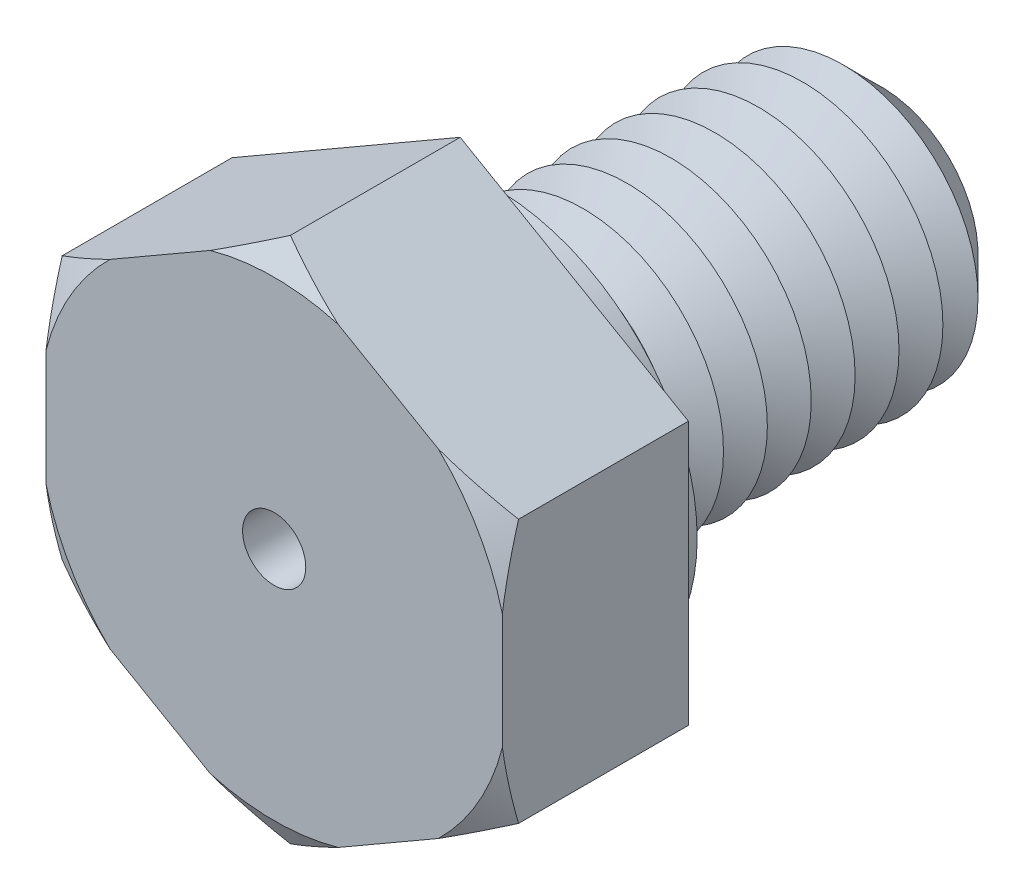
ISO-10303-21;
HEADER;
FILE_DESCRIPTION(('STEP AP214'),'2;1');
FILE_NAME('part.step','',(''),(''),'','','');
FILE_SCHEMA(('AUTOMOTIVE_DESIGN { 1 0 10303 214 1 1 1 1 }'));
ENDSEC;
DATA;
#1=APPLICATION_CONTEXT('core data for automotive mechanical design processes');
#2=APPLICATION_PROTOCOL_DEFINITION('international standard','automotive_design',2000,#1);
#3=PRODUCT_CONTEXT('',#1,'mechanical');
#4=PRODUCT('Part','Part','',(#3));
#5=PRODUCT_RELATED_PRODUCT_CATEGORY('part','',(#4));
#6=PRODUCT_DEFINITION_FORMATION('','',#4);
#7=PRODUCT_DEFINITION_CONTEXT('part definition',#1,'design');
#8=PRODUCT_DEFINITION('design','',#6,#7);
#9=PRODUCT_DEFINITION_SHAPE('','',#8);
#10=(LENGTH_UNIT() NAMED_UNIT(*) SI_UNIT(.MILLI.,.METRE.));
#11=(NAMED_UNIT(*) PLANE_ANGLE_UNIT() SI_UNIT($,.RADIAN.));
#12=(NAMED_UNIT(*) SI_UNIT($,.STERADIAN.) SOLID_ANGLE_UNIT());
#13=UNCERTAINTY_MEASURE_WITH_UNIT(LENGTH_MEASURE(1.E-05),#10,'distance_accuracy_value','');
#14=(GEOMETRIC_REPRESENTATION_CONTEXT(3) GLOBAL_UNCERTAINTY_ASSIGNED_CONTEXT((#13)) GLOBAL_UNIT_ASSIGNED_CONTEXT((#10,
#11,#12)) REPRESENTATION_CONTEXT('',''));
#15=CARTESIAN_POINT('',(0.,0.,0.));
#16=DIRECTION('',(0.,0.,1.));
#17=DIRECTION('',(1.,0.,0.));
#18=AXIS2_PLACEMENT_3D('',#15,#16,#17);
#19=CARTESIAN_POINT('',(6.5,3.75277674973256,5.3));
#20=DIRECTION('',(-0.5,-0.866025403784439,0.));
#21=DIRECTION('',(0.866025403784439,-0.5,0.));
#22=AXIS2_PLACEMENT_3D('',#19,#20,#21);
#23=PLANE('',#22);
#24=CARTESIAN_POINT('',(11.0120510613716,1.14774285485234,2.77920306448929));
#25=CARTESIAN_POINT('',(10.8078344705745,1.26564735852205,2.88939185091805));
#26=CARTESIAN_POINT('',(10.6031290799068,1.38383407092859,2.99839128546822));
#27=CARTESIAN_POINT('',(10.1925345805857,1.6208909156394,3.21345290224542));
#28=CARTESIAN_POINT('',(9.98664532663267,1.73976113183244,3.31951471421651));
#29=CARTESIAN_POINT('',(9.57286478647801,1.97865743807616,3.52844955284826));
#30=CARTESIAN_POINT('',(9.36496919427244,2.09868601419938,3.63131124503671));
#31=CARTESIAN_POINT('',(8.9476201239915,2.33964261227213,3.83272114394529));
#32=CARTESIAN_POINT('',(8.73816669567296,2.46057060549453,3.93126948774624));
#33=CARTESIAN_POINT('',(8.31210847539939,2.70655543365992,4.12554493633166));
#34=CARTESIAN_POINT('',(8.0954571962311,2.83163910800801,4.22113674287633));
#35=CARTESIAN_POINT('',(7.65996896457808,3.0830683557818,4.40550790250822));
#36=CARTESIAN_POINT('',(7.44113190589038,3.2094139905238,4.49428692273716));
#37=CARTESIAN_POINT('',(7.00122142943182,3.46339642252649,4.66334180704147));
#38=CARTESIAN_POINT('',(6.78015039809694,3.59103184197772,4.74362587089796));
#39=CARTESIAN_POINT('',(6.3354128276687,3.8478011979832,4.89383693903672));
#40=CARTESIAN_POINT('',(6.11174662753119,3.97693493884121,4.96376527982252));
#41=CARTESIAN_POINT('',(5.57683009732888,4.2857691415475,5.11501441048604));
#42=CARTESIAN_POINT('',(5.26433342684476,4.46618917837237,5.19069976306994));
#43=CARTESIAN_POINT('',(4.79238520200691,4.73866861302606,5.28165255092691));
#44=CARTESIAN_POINT('',(4.63453792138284,4.82980178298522,5.30820735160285));
#45=CARTESIAN_POINT('',(4.31797843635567,5.01256748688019,5.35312391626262));
#46=CARTESIAN_POINT('',(4.15926635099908,5.10419995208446,5.37148678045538));
#47=CARTESIAN_POINT('',(3.84309853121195,5.28673952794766,5.3993333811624));
#48=CARTESIAN_POINT('',(3.68564943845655,5.37764280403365,5.40891715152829));
#49=CARTESIAN_POINT('',(3.37053331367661,5.55957518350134,5.41928234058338));
#50=CARTESIAN_POINT('',(3.21286628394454,5.65060428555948,5.42006385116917));
#51=CARTESIAN_POINT('',(2.89768626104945,5.83257355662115,5.4127996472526));
#52=CARTESIAN_POINT('',(2.74017326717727,5.92351372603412,5.40475397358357));
#53=CARTESIAN_POINT('',(2.42563627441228,6.10511174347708,5.38007889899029));
#54=CARTESIAN_POINT('',(2.26861235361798,6.19576954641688,5.36344819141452));
#55=CARTESIAN_POINT('',(1.8976455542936,6.40994732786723,5.31443879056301));
#56=CARTESIAN_POINT('',(1.6840512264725,6.53326607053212,5.27851525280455));
#57=CARTESIAN_POINT('',(1.25890710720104,6.77872314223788,5.19313397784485));
#58=CARTESIAN_POINT('',(1.04735761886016,6.90086129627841,5.14367426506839));
#59=CARTESIAN_POINT('',(0.626329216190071,7.14394215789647,5.03308780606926));
#60=CARTESIAN_POINT('',(0.416852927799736,7.26488334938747,4.97194786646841));
#61=CARTESIAN_POINT('',(0.000251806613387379,7.50540811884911,4.83992704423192));
#62=CARTESIAN_POINT('',(-0.206873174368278,7.62499178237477,4.76904677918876));
#63=CARTESIAN_POINT('',(-0.621367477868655,7.86430018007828,4.61833709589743));
#64=CARTESIAN_POINT('',(-0.828710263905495,7.98400959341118,4.53841104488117));
#65=CARTESIAN_POINT('',(-1.2411992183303,8.22216020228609,4.3718486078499));
#66=CARTESIAN_POINT('',(-1.44634674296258,8.34060218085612,4.2852166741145));
#67=CARTESIAN_POINT('',(-1.85477207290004,8.57640665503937,4.10643213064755));
#68=CARTESIAN_POINT('',(-2.05805026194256,8.69376937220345,4.01428068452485));
#69=CARTESIAN_POINT('',(-2.46301289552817,8.92757465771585,3.82542322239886));
#70=CARTESIAN_POINT('',(-2.66469731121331,9.04401720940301,3.72871712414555));
#71=CARTESIAN_POINT('',(-3.00477721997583,9.24036243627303,3.56190249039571));
#72=CARTESIAN_POINT('',(-3.14353507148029,9.32047431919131,3.49277477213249));
#73=CARTESIAN_POINT('',(-3.42044427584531,9.48034792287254,3.35293264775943));
#74=CARTESIAN_POINT('',(-3.55859564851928,9.56010965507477,3.28221829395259));
#75=CARTESIAN_POINT('',(-3.83290330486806,9.71848125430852,3.14014092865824));
#76=CARTESIAN_POINT('',(-3.96906528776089,9.79709441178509,3.06879256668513));
#77=CARTESIAN_POINT('',(-4.24090766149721,9.9540426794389,2.92487520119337));
#78=CARTESIAN_POINT('',(-4.37658804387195,10.0323777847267,2.85230617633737));
#79=CARTESIAN_POINT('',(-4.5120510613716,10.1105873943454,2.77920306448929));
#80=B_SPLINE_CURVE_WITH_KNOTS('',3,(#24,#25,#26,#27,#28,#29,#30,#31,#32,#33,#34,#35,#36,#37,#38,
#39,#40,#41,#42,#43,#44,#45,#46,#47,#48,#49,#50,#51,#52,#53,#54,#55,#56,#57,#58,#59,#60,#61,#62,
#63,#64,#65,#66,#67,#68,#69,#70,#71,#72,#73,#74,#75,#76,#77,#78,#79),.UNSPECIFIED.,.F.,.F.,(4,2,
2,2,2,2,2,2,2,2,2,2,2,2,2,2,2,2,2,2,2,2,2,2,2,2,2,4),(0.,0.780858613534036,1.56181520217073,
2.34527979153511,3.12871946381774,3.93206444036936,4.73544864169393,5.53805016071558,
6.34054800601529,7.44542333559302,7.99784254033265,8.55018753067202,9.096157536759,
9.64212184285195,10.1880836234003,10.7341285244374,11.4813961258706,12.2287728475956,
12.9769988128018,13.7251773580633,14.4822772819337,15.2388787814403,15.9953213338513,
16.7517775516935,17.2752695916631,17.7987444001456,18.3167123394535,18.8346893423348),.UNSPECIFIED.);
#81=CARTESIAN_POINT('',(6.5,3.75277674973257,4.83811978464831));
#82=VERTEX_POINT('',#81);
#83=CARTESIAN_POINT('',(4.67682717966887,4.80538606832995,5.3));
#84=VERTEX_POINT('',#83);
#85=EDGE_CURVE('E132',#82,#84,#80,.T.);
#86=ORIENTED_EDGE('',*,*,#85,.F.);
#87=DIRECTION('',(0.,0.,-1.));
#88=VECTOR('',#87,1.);
#89=CARTESIAN_POINT('',(6.5,3.75277674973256,5.3));
#90=LINE('',#89,#88);
#91=CARTESIAN_POINT('',(6.5,3.75277674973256,0.));
#92=VERTEX_POINT('',#91);
#93=EDGE_CURVE('E144',#82,#92,#90,.T.);
#94=ORIENTED_EDGE('',*,*,#93,.T.);
#95=DIRECTION('',(-0.866025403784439,0.5,0.));
#96=VECTOR('',#95,1.);
#97=CARTESIAN_POINT('',(6.5,3.75277674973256,0.));
#98=LINE('',#97,#96);
#99=CARTESIAN_POINT('',(0.,7.50555349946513,0.));
#100=VERTEX_POINT('',#99);
#101=EDGE_CURVE('E266',#92,#100,#98,.T.);
#102=ORIENTED_EDGE('',*,*,#101,.T.);
#103=DIRECTION('',(0.,0.,-1.));
#104=VECTOR('',#103,1.);
#105=CARTESIAN_POINT('',(0.,7.50555349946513,5.3));
#106=LINE('',#105,#104);
#107=CARTESIAN_POINT('',(0.,7.50555349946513,4.83811978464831));
#108=VERTEX_POINT('',#107);
#109=EDGE_CURVE('E179',#108,#100,#106,.T.);
#110=ORIENTED_EDGE('',*,*,#109,.F.);
#111=CARTESIAN_POINT('',(1.82317282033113,6.45294418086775,5.3));
#112=VERTEX_POINT('',#111);
#113=EDGE_CURVE('E151',#112,#108,#80,.T.);
#114=ORIENTED_EDGE('',*,*,#113,.F.);
#115=DIRECTION('',(-0.866025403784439,0.5,0.));
#116=VECTOR('',#115,1.);
#117=CARTESIAN_POINT('',(6.5,3.75277674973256,5.3));
#118=LINE('',#117,#116);
#119=EDGE_CURVE('E148',#84,#112,#118,.T.);
#120=ORIENTED_EDGE('',*,*,#119,.F.);
#121=EDGE_LOOP('',(#86,#94,#102,#110,#114,#120));
#122=FACE_BOUND('',#121,.T.);
#123=ADVANCED_FACE('F39',(#122),#23,.F.);
#124=CARTESIAN_POINT('',(0.,7.50555349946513,5.3));
#125=DIRECTION('',(0.5,-0.866025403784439,0.));
#126=DIRECTION('',(0.866025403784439,0.5,0.));
#127=AXIS2_PLACEMENT_3D('',#124,#125,#126);
#128=PLANE('',#127);
#129=CARTESIAN_POINT('',(4.5120510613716,10.1105873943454,2.77920306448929));
#130=CARTESIAN_POINT('',(4.30783447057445,9.99268289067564,2.88939185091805));
#131=CARTESIAN_POINT('',(4.1031290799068,9.87449617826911,2.99839128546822));
#132=CARTESIAN_POINT('',(3.69253458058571,9.63743933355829,3.21345290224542));
#133=CARTESIAN_POINT('',(3.48664532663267,9.51856911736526,3.31951471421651));
#134=CARTESIAN_POINT('',(3.07286478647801,9.27967281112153,3.52844955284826));
#135=CARTESIAN_POINT('',(2.86496919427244,9.15964423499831,3.63131124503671));
#136=CARTESIAN_POINT('',(2.4476201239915,8.91868763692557,3.83272114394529));
#137=CARTESIAN_POINT('',(2.23816669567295,8.79775964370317,3.93126948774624));
#138=CARTESIAN_POINT('',(1.81210847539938,8.55177481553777,4.12554493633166));
#139=CARTESIAN_POINT('',(1.5954571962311,8.42669114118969,4.22113674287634));
#140=CARTESIAN_POINT('',(1.15996896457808,8.1752618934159,4.40550790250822));
#141=CARTESIAN_POINT('',(0.941131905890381,8.04891625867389,4.49428692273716));
#142=CARTESIAN_POINT('',(0.501221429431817,7.7949338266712,4.66334180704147));
#143=CARTESIAN_POINT('',(0.280150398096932,7.66729840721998,4.74362587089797));
#144=CARTESIAN_POINT('',(-0.164587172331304,7.4105290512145,4.89383693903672));
#145=CARTESIAN_POINT('',(-0.388253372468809,7.28139531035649,4.96376527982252));
#146=CARTESIAN_POINT('',(-0.923169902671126,6.9725611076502,5.11501441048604));
#147=CARTESIAN_POINT('',(-1.23566657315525,6.79214107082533,5.19069976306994));
#148=CARTESIAN_POINT('',(-1.70761479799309,6.51966163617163,5.28165255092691));
#149=CARTESIAN_POINT('',(-1.86546207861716,6.42852846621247,5.30820735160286));
#150=CARTESIAN_POINT('',(-2.18202156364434,6.24576276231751,5.35312391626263));
#151=CARTESIAN_POINT('',(-2.34073364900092,6.15413029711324,5.37148678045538));
#152=CARTESIAN_POINT('',(-2.65690146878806,5.97159072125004,5.3993333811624));
#153=CARTESIAN_POINT('',(-2.81435056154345,5.88068744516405,5.40891715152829));
#154=CARTESIAN_POINT('',(-3.12946668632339,5.69875506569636,5.41928234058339));
#155=CARTESIAN_POINT('',(-3.28713371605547,5.60772596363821,5.42006385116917));
#156=CARTESIAN_POINT('',(-3.60231373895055,5.42575669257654,5.4127996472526));
#157=CARTESIAN_POINT('',(-3.75982673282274,5.33481652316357,5.40475397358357));
#158=CARTESIAN_POINT('',(-4.07436372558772,5.15321850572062,5.38007889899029));
#159=CARTESIAN_POINT('',(-4.23138764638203,5.06256070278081,5.36344819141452));
#160=CARTESIAN_POINT('',(-4.60235444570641,4.84838292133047,5.31443879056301));
#161=CARTESIAN_POINT('',(-4.81594877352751,4.72506417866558,5.27851525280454));
#162=CARTESIAN_POINT('',(-5.24109289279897,4.47960710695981,5.19313397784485));
#163=CARTESIAN_POINT('',(-5.45264238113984,4.35746895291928,5.14367426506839));
#164=CARTESIAN_POINT('',(-5.87367078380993,4.11438809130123,5.03308780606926));
#165=CARTESIAN_POINT('',(-6.08314707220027,3.99344689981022,4.97194786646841));
#166=CARTESIAN_POINT('',(-6.49974819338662,3.75292213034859,4.83992704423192));
#167=CARTESIAN_POINT('',(-6.70687317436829,3.63333846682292,4.76904677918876));
#168=CARTESIAN_POINT('',(-7.12136747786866,3.39403006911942,4.61833709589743));
#169=CARTESIAN_POINT('',(-7.3287102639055,3.27432065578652,4.53841104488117));
#170=CARTESIAN_POINT('',(-7.74119921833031,3.03617004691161,4.3718486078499));
#171=CARTESIAN_POINT('',(-7.94634674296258,2.91772806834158,4.2852166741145));
#172=CARTESIAN_POINT('',(-8.35477207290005,2.68192359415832,4.10643213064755));
#173=CARTESIAN_POINT('',(-8.55805026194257,2.56456087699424,4.01428068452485));
#174=CARTESIAN_POINT('',(-8.96301289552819,2.33075559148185,3.82542322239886));
#175=CARTESIAN_POINT('',(-9.16469731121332,2.21431303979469,3.72871712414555));
#176=CARTESIAN_POINT('',(-9.50477721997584,2.01796781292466,3.5619024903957));
#177=CARTESIAN_POINT('',(-9.6435350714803,1.93785593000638,3.49277477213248));
#178=CARTESIAN_POINT('',(-9.92044427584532,1.77798232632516,3.35293264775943));
#179=CARTESIAN_POINT('',(-10.0585956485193,1.69822059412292,3.28221829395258));
#180=CARTESIAN_POINT('',(-10.3329033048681,1.53984899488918,3.14014092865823));
#181=CARTESIAN_POINT('',(-10.4690652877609,1.46123583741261,3.06879256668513));
#182=CARTESIAN_POINT('',(-10.7409076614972,1.3042875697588,2.92487520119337));
#183=CARTESIAN_POINT('',(-10.876588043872,1.225952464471,2.85230617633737));
#184=CARTESIAN_POINT('',(-11.0120510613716,1.14774285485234,2.77920306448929));
#185=B_SPLINE_CURVE_WITH_KNOTS('',3,(#129,#130,#131,#132,#133,#134,#135,#136,#137,#138,#139,
#140,#141,#142,#143,#144,#145,#146,#147,#148,#149,#150,#151,#152,#153,#154,#155,#156,#157,#158,
#159,#160,#161,#162,#163,#164,#165,#166,#167,#168,#169,#170,#171,#172,#173,#174,#175,#176,#177,
#178,#179,#180,#181,#182,#183,#184),.UNSPECIFIED.,.F.,.F.,(4,2,2,2,2,2,2,2,2,2,2,2,2,2,2,2,2,2,
2,2,2,2,2,2,2,2,2,4),(0.,0.780858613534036,1.56181520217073,2.34527979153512,3.12871946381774,
3.93206444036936,4.73544864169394,5.53805016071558,6.34054800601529,7.44542333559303,
7.99784254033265,8.55018753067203,9.096157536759,9.64212184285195,10.1880836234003,
10.7341285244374,11.4813961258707,12.2287728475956,12.9769988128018,13.7251773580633,
14.4822772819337,15.2388787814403,15.9953213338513,16.7517775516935,17.2752695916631,
17.7987444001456,18.3167123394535,18.8346893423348),.UNSPECIFIED.);
#186=CARTESIAN_POINT('',(-1.82317282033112,6.45294418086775,5.3));
#187=VERTEX_POINT('',#186);
#188=EDGE_CURVE('E744',#108,#187,#185,.T.);
#189=ORIENTED_EDGE('',*,*,#188,.F.);
#190=ORIENTED_EDGE('',*,*,#109,.T.);
#191=DIRECTION('',(-0.866025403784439,-0.5,0.));
#192=VECTOR('',#191,1.);
#193=CARTESIAN_POINT('',(0.,7.50555349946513,0.));
#194=LINE('',#193,#192);
#195=CARTESIAN_POINT('',(-6.5,3.75277674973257,0.));
#196=VERTEX_POINT('',#195);
#197=EDGE_CURVE('E285',#100,#196,#194,.T.);
#198=ORIENTED_EDGE('',*,*,#197,.T.);
#199=DIRECTION('',(0.,0.,-1.));
#200=VECTOR('',#199,1.);
#201=CARTESIAN_POINT('',(-6.5,3.75277674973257,5.3));
#202=LINE('',#201,#200);
#203=CARTESIAN_POINT('',(-6.5,3.75277674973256,4.83811978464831));
#204=VERTEX_POINT('',#203);
#205=EDGE_CURVE('E176',#204,#196,#202,.T.);
#206=ORIENTED_EDGE('',*,*,#205,.F.);
#207=CARTESIAN_POINT('',(-4.67682717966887,4.80538606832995,5.3));
#208=VERTEX_POINT('',#207);
#209=EDGE_CURVE('E370',#208,#204,#185,.T.);
#210=ORIENTED_EDGE('',*,*,#209,.F.);
#211=DIRECTION('',(-0.866025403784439,-0.5,0.));
#212=VECTOR('',#211,1.);
#213=CARTESIAN_POINT('',(0.,7.50555349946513,5.3));
#214=LINE('',#213,#212);
#215=EDGE_CURVE('E269',#187,#208,#214,.T.);
#216=ORIENTED_EDGE('',*,*,#215,.F.);
#217=EDGE_LOOP('',(#189,#190,#198,#206,#210,#216));
#218=FACE_BOUND('',#217,.T.);
#219=ADVANCED_FACE('F379',(#218),#128,.F.);
#220=CARTESIAN_POINT('',(-6.5,3.75277674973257,5.3));
#221=DIRECTION('',(1.,0.,0.));
#222=DIRECTION('',(0.,0.,-1.));
#223=AXIS2_PLACEMENT_3D('',#220,#221,#222);
#224=PLANE('',#223);
#225=CARTESIAN_POINT('',(-6.5,8.26482781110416,3.10083044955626));
#226=CARTESIAN_POINT('',(-6.5,8.03000458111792,3.20736842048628));
#227=CARTESIAN_POINT('',(-6.5,7.79453887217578,3.31251727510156));
#228=CARTESIAN_POINT('',(-6.5,7.32204728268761,3.51936269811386));
#229=CARTESIAN_POINT('',(-6.5,7.08502112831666,3.62105864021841));
#230=CARTESIAN_POINT('',(-6.5,6.6082238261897,3.82070151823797));
#231=CARTESIAN_POINT('',(-6.5,6.36844534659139,3.91863101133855));
#232=CARTESIAN_POINT('',(-6.5,5.88686103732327,4.10935828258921));
#233=CARTESIAN_POINT('',(-6.5,5.64505530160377,4.20215629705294));
#234=CARTESIAN_POINT('',(-6.5,5.16020806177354,4.38107583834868));
#235=CARTESIAN_POINT('',(-6.5,4.91717698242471,4.46722547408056));
#236=CARTESIAN_POINT('',(-6.5,4.42851680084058,4.63190822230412));
#237=CARTESIAN_POINT('',(-6.5,4.18288757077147,4.71044095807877));
#238=CARTESIAN_POINT('',(-6.5,3.68915983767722,4.85808723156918));
#239=CARTESIAN_POINT('',(-6.5,3.44106517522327,4.9272135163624));
#240=CARTESIAN_POINT('',(-6.5,2.94198131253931,5.05420795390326));
#241=CARTESIAN_POINT('',(-6.5,2.69099223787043,5.1120765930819));
#242=CARTESIAN_POINT('',(-6.5,2.25769005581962,5.19995201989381));
#243=CARTESIAN_POINT('',(-6.5,2.07603591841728,5.23320954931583));
#244=CARTESIAN_POINT('',(-6.5,1.71151122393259,5.29207741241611));
#245=CARTESIAN_POINT('',(-6.5,1.52864087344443,5.31768901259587));
#246=CARTESIAN_POINT('',(-6.5,1.16195360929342,5.36059506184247));
#247=CARTESIAN_POINT('',(-6.5,0.978136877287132,5.37789105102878));
#248=CARTESIAN_POINT('',(-6.5,0.609880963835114,5.40367049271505));
#249=CARTESIAN_POINT('',(-6.5,0.425441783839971,5.41215396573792));
#250=CARTESIAN_POINT('',(-6.5,0.0564612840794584,5.42004368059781));
#251=CARTESIAN_POINT('',(-6.5,-0.128079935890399,5.41945454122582));
#252=CARTESIAN_POINT('',(-6.5,-0.49690745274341,5.40922941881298));
#253=CARTESIAN_POINT('',(-6.5,-0.681193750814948,5.39959347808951));
#254=CARTESIAN_POINT('',(-6.5,-1.04910266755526,5.37156866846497));
#255=CARTESIAN_POINT('',(-6.5,-1.23272526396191,5.35317950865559));
#256=CARTESIAN_POINT('',(-6.5,-1.5989735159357,5.30817918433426));
#257=CARTESIAN_POINT('',(-6.5,-1.78159898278,5.28156651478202));
#258=CARTESIAN_POINT('',(-6.5,-2.5090476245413,5.16009602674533));
#259=CARTESIAN_POINT('',(-6.5,-3.04897729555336,5.0350728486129));
#260=CARTESIAN_POINT('',(-6.5,-3.8489021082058,4.8122065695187));
#261=CARTESIAN_POINT('',(-6.5,-4.11422810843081,4.73189887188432));
#262=CARTESIAN_POINT('',(-6.5,-4.64182213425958,4.5617271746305));
#263=CARTESIAN_POINT('',(-6.5,-4.90409037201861,4.47186384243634));
#264=CARTESIAN_POINT('',(-6.5,-5.42881258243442,4.28339622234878));
#265=CARTESIAN_POINT('',(-6.5,-5.69123450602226,4.18470387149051));
#266=CARTESIAN_POINT('',(-6.5,-6.21363007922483,3.98100889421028));
#267=CARTESIAN_POINT('',(-6.5,-6.4736035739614,3.87600587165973));
#268=CARTESIAN_POINT('',(-6.5,-6.98982707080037,3.66159357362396));
#269=CARTESIAN_POINT('',(-6.5,-7.24609016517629,3.55221565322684));
#270=CARTESIAN_POINT('',(-6.5,-7.75676014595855,3.32937132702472));
#271=CARTESIAN_POINT('',(-6.5,-8.0111674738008,3.21590593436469));
#272=CARTESIAN_POINT('',(-6.5,-8.26482781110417,3.10083044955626));
#273=B_SPLINE_CURVE_WITH_KNOTS('',3,(#225,#226,#227,#228,#229,#230,#231,#232,#233,#234,#235,
#236,#237,#238,#239,#240,#241,#242,#243,#244,#245,#246,#247,#248,#249,#250,#251,#252,#253,#254,
#255,#256,#257,#258,#259,#260,#261,#262,#263,#264,#265,#266,#267,#268,#269,#270,#271,#272),
.UNSPECIFIED.,.F.,.F.,(4,2,2,2,2,2,2,2,2,2,2,2,2,2,2,2,2,2,2,2,2,2,2,4),(0.,0.773595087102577,
1.54732974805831,2.3242977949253,3.10123003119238,3.87467353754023,4.64815527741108,
5.42057817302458,6.19296768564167,6.74684672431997,7.30063396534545,7.85431860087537,
8.40800194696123,8.96140342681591,9.51480231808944,10.0682196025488,10.621738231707,
12.2804682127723,13.1120468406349,13.9435674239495,14.7845791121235,15.625643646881,
16.4614935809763,17.2971377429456),.UNSPECIFIED.);
#274=CARTESIAN_POINT('',(-6.5,1.64755811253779,5.3));
#275=VERTEX_POINT('',#274);
#276=EDGE_CURVE('E369',#204,#275,#273,.T.);
#277=ORIENTED_EDGE('',*,*,#276,.F.);
#278=ORIENTED_EDGE('',*,*,#205,.T.);
#279=DIRECTION('',(0.,-1.,0.));
#280=VECTOR('',#279,1.);
#281=CARTESIAN_POINT('',(-6.5,3.75277674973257,0.));
#282=LINE('',#281,#280);
#283=CARTESIAN_POINT('',(-6.5,-3.75277674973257,0.));
#284=VERTEX_POINT('',#283);
#285=EDGE_CURVE('E289',#196,#284,#282,.T.);
#286=ORIENTED_EDGE('',*,*,#285,.T.);
#287=DIRECTION('',(0.,0.,-1.));
#288=VECTOR('',#287,1.);
#289=CARTESIAN_POINT('',(-6.5,-3.75277674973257,5.3));
#290=LINE('',#289,#288);
#291=CARTESIAN_POINT('',(-6.49999999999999,-3.75277674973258,4.83811978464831));
#292=VERTEX_POINT('',#291);
#293=EDGE_CURVE('E173',#292,#284,#290,.T.);
#294=ORIENTED_EDGE('',*,*,#293,.F.);
#295=CARTESIAN_POINT('',(-6.5,-1.64755811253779,5.3));
#296=VERTEX_POINT('',#295);
#297=EDGE_CURVE('E308',#296,#292,#273,.T.);
#298=ORIENTED_EDGE('',*,*,#297,.F.);
#299=DIRECTION('',(0.,-1.,0.));
#300=VECTOR('',#299,1.);
#301=CARTESIAN_POINT('',(-6.5,3.75277674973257,5.3));
#302=LINE('',#301,#300);
#303=EDGE_CURVE('E273',#275,#296,#302,.T.);
#304=ORIENTED_EDGE('',*,*,#303,.F.);
#305=EDGE_LOOP('',(#277,#278,#286,#294,#298,#304));
#306=FACE_BOUND('',#305,.T.);
#307=ADVANCED_FACE('F375',(#306),#224,.F.);
#308=CARTESIAN_POINT('',(-6.5,-3.75277674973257,5.3));
#309=DIRECTION('',(0.5,0.866025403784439,0.));
#310=DIRECTION('',(-0.866025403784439,0.5,0.));
#311=AXIS2_PLACEMENT_3D('',#308,#309,#310);
#312=PLANE('',#311);
#313=CARTESIAN_POINT('',(-11.0120510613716,-1.14774285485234,2.77920306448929));
#314=CARTESIAN_POINT('',(-10.8078344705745,-1.26564735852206,2.88939185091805));
#315=CARTESIAN_POINT('',(-10.6031290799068,-1.3838340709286,2.99839128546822));
#316=CARTESIAN_POINT('',(-10.1925345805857,-1.62089091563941,3.21345290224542));
#317=CARTESIAN_POINT('',(-9.98664532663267,-1.73976113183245,3.31951471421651));
#318=CARTESIAN_POINT('',(-9.572864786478,-1.97865743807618,3.52844955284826));
#319=CARTESIAN_POINT('',(-9.36496919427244,-2.09868601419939,3.63131124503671));
#320=CARTESIAN_POINT('',(-8.94762012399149,-2.33964261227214,3.83272114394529));
#321=CARTESIAN_POINT('',(-8.73816669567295,-2.46057060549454,3.93126948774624));
#322=CARTESIAN_POINT('',(-8.31210847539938,-2.70655543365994,4.12554493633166));
#323=CARTESIAN_POINT('',(-8.0954571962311,-2.83163910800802,4.22113674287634));
#324=CARTESIAN_POINT('',(-7.65996896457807,-3.08306835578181,4.40550790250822));
#325=CARTESIAN_POINT('',(-7.44113190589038,-3.20941399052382,4.49428692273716));
#326=CARTESIAN_POINT('',(-7.00122142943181,-3.46339642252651,4.66334180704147));
#327=CARTESIAN_POINT('',(-6.78015039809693,-3.59103184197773,4.74362587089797));
#328=CARTESIAN_POINT('',(-6.33541282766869,-3.84780119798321,4.89383693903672));
#329=CARTESIAN_POINT('',(-6.11174662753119,-3.97693493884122,4.96376527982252));
#330=CARTESIAN_POINT('',(-5.57683009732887,-4.28576914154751,5.11501441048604));
#331=CARTESIAN_POINT('',(-5.26433342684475,-4.46618917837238,5.19069976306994));
#332=CARTESIAN_POINT('',(-4.7923852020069,-4.73866861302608,5.28165255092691));
#333=CARTESIAN_POINT('',(-4.63453792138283,-4.82980178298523,5.30820735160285));
#334=CARTESIAN_POINT('',(-4.31797843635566,-5.0125674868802,5.35312391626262));
#335=CARTESIAN_POINT('',(-4.15926635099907,-5.10419995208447,5.37148678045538));
#336=CARTESIAN_POINT('',(-3.84309853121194,-5.28673952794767,5.39933338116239));
#337=CARTESIAN_POINT('',(-3.68564943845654,-5.37764280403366,5.40891715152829));
#338=CARTESIAN_POINT('',(-3.3705333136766,-5.55957518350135,5.41928234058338));
#339=CARTESIAN_POINT('',(-3.21286628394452,-5.6506042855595,5.42006385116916));
#340=CARTESIAN_POINT('',(-2.89768626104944,-5.83257355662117,5.41279964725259));
#341=CARTESIAN_POINT('',(-2.74017326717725,-5.92351372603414,5.40475397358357));
#342=CARTESIAN_POINT('',(-2.42563627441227,-6.1051117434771,5.38007889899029));
#343=CARTESIAN_POINT('',(-2.26861235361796,-6.1957695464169,5.36344819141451));
#344=CARTESIAN_POINT('',(-1.89764555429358,-6.40994732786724,5.314438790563));
#345=CARTESIAN_POINT('',(-1.68405122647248,-6.53326607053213,5.27851525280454));
#346=CARTESIAN_POINT('',(-1.25890710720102,-6.7787231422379,5.19313397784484));
#347=CARTESIAN_POINT('',(-1.04735761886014,-6.90086129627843,5.14367426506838));
#348=CARTESIAN_POINT('',(-0.626329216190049,-7.14394215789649,5.03308780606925));
#349=CARTESIAN_POINT('',(-0.416852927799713,-7.26488334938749,4.9719478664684));
#350=CARTESIAN_POINT('',(-0.000251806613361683,-7.50540811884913,4.83992704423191));
#351=CARTESIAN_POINT('',(0.206873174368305,-7.62499178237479,4.76904677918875));
#352=CARTESIAN_POINT('',(0.621367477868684,-7.8643001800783,4.61833709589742));
#353=CARTESIAN_POINT('',(0.828710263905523,-7.9840095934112,4.53841104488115));
#354=CARTESIAN_POINT('',(1.24119921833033,-8.22216020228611,4.37184860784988));
#355=CARTESIAN_POINT('',(1.44634674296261,-8.34060218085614,4.28521667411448));
#356=CARTESIAN_POINT('',(1.85477207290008,-8.5764066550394,4.10643213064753));
#357=CARTESIAN_POINT('',(2.0580502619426,-8.69376937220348,4.01428068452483));
#358=CARTESIAN_POINT('',(2.46301289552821,-8.92757465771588,3.82542322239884));
#359=CARTESIAN_POINT('',(2.66469731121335,-9.04401720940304,3.72871712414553));
#360=CARTESIAN_POINT('',(3.00477721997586,-9.24036243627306,3.56190249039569));
#361=CARTESIAN_POINT('',(3.14353507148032,-9.32047431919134,3.49277477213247));
#362=CARTESIAN_POINT('',(3.42044427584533,-9.48034792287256,3.35293264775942));
#363=CARTESIAN_POINT('',(3.55859564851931,-9.56010965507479,3.28221829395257));
#364=CARTESIAN_POINT('',(3.83290330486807,-9.71848125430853,3.14014092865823));
#365=CARTESIAN_POINT('',(3.9690652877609,-9.7970944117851,3.06879256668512));
#366=CARTESIAN_POINT('',(4.24090766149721,-9.9540426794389,2.92487520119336));
#367=CARTESIAN_POINT('',(4.37658804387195,-10.0323777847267,2.85230617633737));
#368=CARTESIAN_POINT('',(4.51205106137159,-10.1105873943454,2.77920306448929));
#369=B_SPLINE_CURVE_WITH_KNOTS('',3,(#313,#314,#315,#316,#317,#318,#319,#320,#321,#322,#323,
#324,#325,#326,#327,#328,#329,#330,#331,#332,#333,#334,#335,#336,#337,#338,#339,#340,#341,#342,
#343,#344,#345,#346,#347,#348,#349,#350,#351,#352,#353,#354,#355,#356,#357,#358,#359,#360,#361,
#362,#363,#364,#365,#366,#367,#368),.UNSPECIFIED.,.F.,.F.,(4,2,2,2,2,2,2,2,2,2,2,2,2,2,2,2,2,2,
2,2,2,2,2,2,2,2,2,4),(0.,0.780858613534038,1.56181520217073,2.34527979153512,3.12871946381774,
3.93206444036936,4.73544864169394,5.53805016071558,6.3405480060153,7.44542333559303,
7.99784254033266,8.55018753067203,9.09615753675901,9.64212184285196,10.1880836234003,
10.7341285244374,11.4813961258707,12.2287728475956,12.9769988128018,13.7251773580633,
14.4822772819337,15.2388787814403,15.9953213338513,16.7517775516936,17.2752695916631,
17.7987444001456,18.3167123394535,18.8346893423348),.UNSPECIFIED.);
#370=CARTESIAN_POINT('',(-4.67682717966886,-4.80538606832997,5.3));
#371=VERTEX_POINT('',#370);
#372=EDGE_CURVE('E306',#292,#371,#369,.T.);
#373=ORIENTED_EDGE('',*,*,#372,.F.);
#374=ORIENTED_EDGE('',*,*,#293,.T.);
#375=DIRECTION('',(0.866025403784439,-0.5,0.));
#376=VECTOR('',#375,1.);
#377=CARTESIAN_POINT('',(-6.5,-3.75277674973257,0.));
#378=LINE('',#377,#376);
#379=CARTESIAN_POINT('',(0.,-7.50555349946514,0.));
#380=VERTEX_POINT('',#379);
#381=EDGE_CURVE('E293',#284,#380,#378,.T.);
#382=ORIENTED_EDGE('',*,*,#381,.T.);
#383=DIRECTION('',(0.,0.,-1.));
#384=VECTOR('',#383,1.);
#385=CARTESIAN_POINT('',(0.,-7.50555349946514,5.3));
#386=LINE('',#385,#384);
#387=CARTESIAN_POINT('',(0.,-7.50555349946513,4.83811978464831));
#388=VERTEX_POINT('',#387);
#389=EDGE_CURVE('E163',#388,#380,#386,.T.);
#390=ORIENTED_EDGE('',*,*,#389,.F.);
#391=CARTESIAN_POINT('',(-1.82317282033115,-6.45294418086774,5.3));
#392=VERTEX_POINT('',#391);
#393=EDGE_CURVE('E309',#392,#388,#369,.T.);
#394=ORIENTED_EDGE('',*,*,#393,.F.);
#395=DIRECTION('',(0.866025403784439,-0.5,0.));
#396=VECTOR('',#395,1.);
#397=CARTESIAN_POINT('',(-6.5,-3.75277674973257,5.3));
#398=LINE('',#397,#396);
#399=EDGE_CURVE('E277',#371,#392,#398,.T.);
#400=ORIENTED_EDGE('',*,*,#399,.F.);
#401=EDGE_LOOP('',(#373,#374,#382,#390,#394,#400));
#402=FACE_BOUND('',#401,.T.);
#403=ADVANCED_FACE('F378',(#402),#312,.F.);
#404=CARTESIAN_POINT('',(0.,-7.50555349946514,5.3));
#405=DIRECTION('',(-0.5,0.866025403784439,0.));
#406=DIRECTION('',(-0.866025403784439,-0.5,0.));
#407=AXIS2_PLACEMENT_3D('',#404,#405,#406);
#408=PLANE('',#407);
#409=CARTESIAN_POINT('',(-4.5120510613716,-10.1105873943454,2.77920306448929));
#410=CARTESIAN_POINT('',(-4.30783447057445,-9.99268289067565,2.88939185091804));
#411=CARTESIAN_POINT('',(-4.1031290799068,-9.87449617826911,2.99839128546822));
#412=CARTESIAN_POINT('',(-3.69253458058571,-9.6374393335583,3.21345290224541));
#413=CARTESIAN_POINT('',(-3.48664532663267,-9.51856911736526,3.3195147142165));
#414=CARTESIAN_POINT('',(-3.072864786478,-9.27967281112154,3.52844955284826));
#415=CARTESIAN_POINT('',(-2.86496919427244,-9.15964423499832,3.6313112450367));
#416=CARTESIAN_POINT('',(-2.4476201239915,-8.91868763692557,3.83272114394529));
#417=CARTESIAN_POINT('',(-2.23816669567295,-8.79775964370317,3.93126948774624));
#418=CARTESIAN_POINT('',(-1.81210847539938,-8.55177481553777,4.12554493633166));
#419=CARTESIAN_POINT('',(-1.5954571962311,-8.42669114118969,4.22113674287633));
#420=CARTESIAN_POINT('',(-1.15996896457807,-8.1752618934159,4.40550790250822));
#421=CARTESIAN_POINT('',(-0.941131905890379,-8.04891625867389,4.49428692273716));
#422=CARTESIAN_POINT('',(-0.501221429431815,-7.79493382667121,4.66334180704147));
#423=CARTESIAN_POINT('',(-0.28015039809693,-7.66729840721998,4.74362587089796));
#424=CARTESIAN_POINT('',(0.164587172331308,-7.4105290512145,4.89383693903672));
#425=CARTESIAN_POINT('',(0.388253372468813,-7.28139531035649,4.96376527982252));
#426=CARTESIAN_POINT('',(0.92316990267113,-6.9725611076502,5.11501441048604));
#427=CARTESIAN_POINT('',(1.23566657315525,-6.79214107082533,5.19069976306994));
#428=CARTESIAN_POINT('',(1.7076147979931,-6.51966163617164,5.28165255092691));
#429=CARTESIAN_POINT('',(1.86546207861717,-6.42852846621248,5.30820735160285));
#430=CARTESIAN_POINT('',(2.18202156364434,-6.24576276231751,5.35312391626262));
#431=CARTESIAN_POINT('',(2.34073364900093,-6.15413029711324,5.37148678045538));
#432=CARTESIAN_POINT('',(2.65690146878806,-5.97159072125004,5.3993333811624));
#433=CARTESIAN_POINT('',(2.81435056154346,-5.88068744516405,5.40891715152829));
#434=CARTESIAN_POINT('',(3.1294666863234,-5.69875506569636,5.41928234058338));
#435=CARTESIAN_POINT('',(3.28713371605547,-5.60772596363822,5.42006385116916));
#436=CARTESIAN_POINT('',(3.60231373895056,-5.42575669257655,5.41279964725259));
#437=CARTESIAN_POINT('',(3.75982673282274,-5.33481652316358,5.40475397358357));
#438=CARTESIAN_POINT('',(4.07436372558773,-5.15321850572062,5.38007889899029));
#439=CARTESIAN_POINT('',(4.23138764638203,-5.06256070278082,5.36344819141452));
#440=CARTESIAN_POINT('',(4.60235444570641,-4.84838292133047,5.31443879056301));
#441=CARTESIAN_POINT('',(4.81594877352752,-4.72506417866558,5.27851525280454));
#442=CARTESIAN_POINT('',(5.24109289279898,-4.47960710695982,5.19313397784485));
#443=CARTESIAN_POINT('',(5.45264238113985,-4.35746895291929,5.14367426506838));
#444=CARTESIAN_POINT('',(5.87367078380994,-4.11438809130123,5.03308780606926));
#445=CARTESIAN_POINT('',(6.08314707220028,-3.99344689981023,4.9719478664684));
#446=CARTESIAN_POINT('',(6.49974819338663,-3.75292213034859,4.83992704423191));
#447=CARTESIAN_POINT('',(6.7068731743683,-3.63333846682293,4.76904677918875));
#448=CARTESIAN_POINT('',(7.12136747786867,-3.39403006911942,4.61833709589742));
#449=CARTESIAN_POINT('',(7.32871026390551,-3.27432065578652,4.53841104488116));
#450=CARTESIAN_POINT('',(7.74119921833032,-3.03617004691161,4.37184860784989));
#451=CARTESIAN_POINT('',(7.9463467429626,-2.91772806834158,4.28521667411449));
#452=CARTESIAN_POINT('',(8.35477207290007,-2.68192359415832,4.10643213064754));
#453=CARTESIAN_POINT('',(8.55805026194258,-2.56456087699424,4.01428068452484));
#454=CARTESIAN_POINT('',(8.9630128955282,-2.33075559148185,3.82542322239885));
#455=CARTESIAN_POINT('',(9.16469731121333,-2.21431303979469,3.72871712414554));
#456=CARTESIAN_POINT('',(9.50477721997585,-2.01796781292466,3.56190249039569));
#457=CARTESIAN_POINT('',(9.64353507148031,-1.93785593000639,3.49277477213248));
#458=CARTESIAN_POINT('',(9.92044427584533,-1.77798232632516,3.35293264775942));
#459=CARTESIAN_POINT('',(10.0585956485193,-1.69822059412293,3.28221829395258));
#460=CARTESIAN_POINT('',(10.3329033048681,-1.53984899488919,3.14014092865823));
#461=CARTESIAN_POINT('',(10.4690652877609,-1.46123583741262,3.06879256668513));
#462=CARTESIAN_POINT('',(10.7409076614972,-1.30428756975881,2.92487520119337));
#463=CARTESIAN_POINT('',(10.876588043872,-1.22595246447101,2.85230617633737));
#464=CARTESIAN_POINT('',(11.0120510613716,-1.14774285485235,2.77920306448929));
#465=B_SPLINE_CURVE_WITH_KNOTS('',3,(#409,#410,#411,#412,#413,#414,#415,#416,#417,#418,#419,
#420,#421,#422,#423,#424,#425,#426,#427,#428,#429,#430,#431,#432,#433,#434,#435,#436,#437,#438,
#439,#440,#441,#442,#443,#444,#445,#446,#447,#448,#449,#450,#451,#452,#453,#454,#455,#456,#457,
#458,#459,#460,#461,#462,#463,#464),.UNSPECIFIED.,.F.,.F.,(4,2,2,2,2,2,2,2,2,2,2,2,2,2,2,2,2,2,
2,2,2,2,2,2,2,2,2,4),(0.,0.780858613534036,1.56181520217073,2.34527979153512,3.12871946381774,
3.93206444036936,4.73544864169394,5.53805016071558,6.3405480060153,7.44542333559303,
7.99784254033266,8.55018753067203,9.09615753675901,9.64212184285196,10.1880836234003,
10.7341285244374,11.4813961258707,12.2287728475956,12.9769988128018,13.7251773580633,
14.4822772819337,15.2388787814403,15.9953213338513,16.7517775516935,17.2752695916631,
17.7987444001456,18.3167123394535,18.8346893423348),.UNSPECIFIED.);
#466=CARTESIAN_POINT('',(1.82317282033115,-6.45294418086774,5.3));
#467=VERTEX_POINT('',#466);
#468=EDGE_CURVE('E64',#388,#467,#465,.T.);
#469=ORIENTED_EDGE('',*,*,#468,.F.);
#470=ORIENTED_EDGE('',*,*,#389,.T.);
#471=DIRECTION('',(0.866025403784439,0.5,0.));
#472=VECTOR('',#471,1.);
#473=CARTESIAN_POINT('',(0.,-7.50555349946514,0.));
#474=LINE('',#473,#472);
#475=CARTESIAN_POINT('',(6.5,-3.75277674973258,0.));
#476=VERTEX_POINT('',#475);
#477=EDGE_CURVE('E296',#380,#476,#474,.T.);
#478=ORIENTED_EDGE('',*,*,#477,.T.);
#479=DIRECTION('',(0.,0.,-1.));
#480=VECTOR('',#479,1.);
#481=CARTESIAN_POINT('',(6.5,-3.75277674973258,5.3));
#482=LINE('',#481,#480);
#483=CARTESIAN_POINT('',(6.5,-3.75277674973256,4.83811978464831));
#484=VERTEX_POINT('',#483);
#485=EDGE_CURVE('E157',#484,#476,#482,.T.);
#486=ORIENTED_EDGE('',*,*,#485,.F.);
#487=CARTESIAN_POINT('',(4.67682717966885,-4.80538606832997,5.3));
#488=VERTEX_POINT('',#487);
#489=EDGE_CURVE('E324',#488,#484,#465,.T.);
#490=ORIENTED_EDGE('',*,*,#489,.F.);
#491=DIRECTION('',(0.866025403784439,0.5,0.));
#492=VECTOR('',#491,1.);
#493=CARTESIAN_POINT('',(0.,-7.50555349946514,5.3));
#494=LINE('',#493,#492);
#495=EDGE_CURVE('E166',#467,#488,#494,.T.);
#496=ORIENTED_EDGE('',*,*,#495,.F.);
#497=EDGE_LOOP('',(#469,#470,#478,#486,#490,#496));
#498=FACE_BOUND('',#497,.T.);
#499=ADVANCED_FACE('F322',(#498),#408,.F.);
#500=CARTESIAN_POINT('',(6.5,-3.75277674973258,5.3));
#501=DIRECTION('',(-1.,0.,0.));
#502=DIRECTION('',(0.,-1.,0.));
#503=AXIS2_PLACEMENT_3D('',#500,#501,#502);
#504=PLANE('',#503);
#505=CARTESIAN_POINT('',(6.5,-8.26482781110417,3.10083044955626));
#506=CARTESIAN_POINT('',(6.5,-8.03000458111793,3.20736842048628));
#507=CARTESIAN_POINT('',(6.5,-7.79453887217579,3.31251727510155));
#508=CARTESIAN_POINT('',(6.5,-7.32204728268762,3.51936269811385));
#509=CARTESIAN_POINT('',(6.5,-7.08502112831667,3.62105864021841));
#510=CARTESIAN_POINT('',(6.5,-6.60822382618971,3.82070151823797));
#511=CARTESIAN_POINT('',(6.5,-6.3684453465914,3.91863101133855));
#512=CARTESIAN_POINT('',(6.5,-5.88686103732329,4.10935828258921));
#513=CARTESIAN_POINT('',(6.5,-5.64505530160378,4.20215629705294));
#514=CARTESIAN_POINT('',(6.5,-5.16020806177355,4.38107583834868));
#515=CARTESIAN_POINT('',(6.5,-4.91717698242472,4.46722547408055));
#516=CARTESIAN_POINT('',(6.5,-4.42851680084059,4.63190822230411));
#517=CARTESIAN_POINT('',(6.5,-4.18288757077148,4.71044095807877));
#518=CARTESIAN_POINT('',(6.5,-3.68915983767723,4.85808723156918));
#519=CARTESIAN_POINT('',(6.5,-3.44106517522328,4.9272135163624));
#520=CARTESIAN_POINT('',(6.5,-2.94198131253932,5.05420795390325));
#521=CARTESIAN_POINT('',(6.5,-2.69099223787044,5.1120765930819));
#522=CARTESIAN_POINT('',(6.5,-2.25769005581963,5.19995201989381));
#523=CARTESIAN_POINT('',(6.5,-2.07603591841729,5.23320954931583));
#524=CARTESIAN_POINT('',(6.5,-1.7115112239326,5.29207741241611));
#525=CARTESIAN_POINT('',(6.5,-1.52864087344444,5.31768901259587));
#526=CARTESIAN_POINT('',(6.5,-1.16195360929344,5.36059506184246));
#527=CARTESIAN_POINT('',(6.5,-0.978136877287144,5.37789105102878));
#528=CARTESIAN_POINT('',(6.5,-0.609880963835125,5.40367049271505));
#529=CARTESIAN_POINT('',(6.5,-0.425441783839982,5.41215396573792));
#530=CARTESIAN_POINT('',(6.5,-0.056461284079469,5.42004368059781));
#531=CARTESIAN_POINT('',(6.5,0.128079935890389,5.41945454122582));
#532=CARTESIAN_POINT('',(6.5,0.496907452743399,5.40922941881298));
#533=CARTESIAN_POINT('',(6.5,0.681193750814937,5.39959347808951));
#534=CARTESIAN_POINT('',(6.5,1.04910266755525,5.37156866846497));
#535=CARTESIAN_POINT('',(6.5,1.2327252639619,5.35317950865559));
#536=CARTESIAN_POINT('',(6.5,1.59897351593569,5.30817918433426));
#537=CARTESIAN_POINT('',(6.5,1.78159898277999,5.28156651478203));
#538=CARTESIAN_POINT('',(6.5,2.50904762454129,5.16009602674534));
#539=CARTESIAN_POINT('',(6.5,3.04897729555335,5.0350728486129));
#540=CARTESIAN_POINT('',(6.5,3.84890210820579,4.8122065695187));
#541=CARTESIAN_POINT('',(6.5,4.1142281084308,4.73189887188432));
#542=CARTESIAN_POINT('',(6.5,4.64182213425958,4.5617271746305));
#543=CARTESIAN_POINT('',(6.5,4.9040903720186,4.47186384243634));
#544=CARTESIAN_POINT('',(6.5,5.42881258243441,4.28339622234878));
#545=CARTESIAN_POINT('',(6.5,5.69123450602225,4.18470387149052));
#546=CARTESIAN_POINT('',(6.5,6.21363007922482,3.98100889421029));
#547=CARTESIAN_POINT('',(6.5,6.47360357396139,3.87600587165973));
#548=CARTESIAN_POINT('',(6.5,6.98982707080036,3.66159357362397));
#549=CARTESIAN_POINT('',(6.5,7.24609016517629,3.55221565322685));
#550=CARTESIAN_POINT('',(6.5,7.75676014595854,3.32937132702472));
#551=CARTESIAN_POINT('',(6.5,8.01116747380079,3.21590593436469));
#552=CARTESIAN_POINT('',(6.5,8.26482781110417,3.10083044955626));
#553=B_SPLINE_CURVE_WITH_KNOTS('',3,(#505,#506,#507,#508,#509,#510,#511,#512,#513,#514,#515,
#516,#517,#518,#519,#520,#521,#522,#523,#524,#525,#526,#527,#528,#529,#530,#531,#532,#533,#534,
#535,#536,#537,#538,#539,#540,#541,#542,#543,#544,#545,#546,#547,#548,#549,#550,#551,#552),
.UNSPECIFIED.,.F.,.F.,(4,2,2,2,2,2,2,2,2,2,2,2,2,2,2,2,2,2,2,2,2,2,2,4),(0.,0.773595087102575,
1.54732974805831,2.3242977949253,3.10123003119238,3.87467353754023,4.64815527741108,
5.42057817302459,6.19296768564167,6.74684672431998,7.30063396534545,7.85431860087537,
8.40800194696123,8.96140342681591,9.51480231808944,10.0682196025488,10.621738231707,
12.2804682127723,13.1120468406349,13.9435674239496,14.7845791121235,15.625643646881,
16.4614935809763,17.2971377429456),.UNSPECIFIED.);
#554=CARTESIAN_POINT('',(6.5,-1.64755811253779,5.3));
#555=VERTEX_POINT('',#554);
#556=EDGE_CURVE('E56',#484,#555,#553,.T.);
#557=ORIENTED_EDGE('',*,*,#556,.F.);
#558=ORIENTED_EDGE('',*,*,#485,.T.);
#559=DIRECTION('',(0.,1.,0.));
#560=VECTOR('',#559,1.);
#561=CARTESIAN_POINT('',(6.5,-3.75277674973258,0.));
#562=LINE('',#561,#560);
#563=EDGE_CURVE('E154',#476,#92,#562,.T.);
#564=ORIENTED_EDGE('',*,*,#563,.T.);
#565=ORIENTED_EDGE('',*,*,#93,.F.);
#566=CARTESIAN_POINT('',(6.5,1.64755811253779,5.3));
#567=VERTEX_POINT('',#566);
#568=EDGE_CURVE('E129',#567,#82,#553,.T.);
#569=ORIENTED_EDGE('',*,*,#568,.F.);
#570=DIRECTION('',(0.,1.,0.));
#571=VECTOR('',#570,1.);
#572=CARTESIAN_POINT('',(6.5,-3.75277674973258,5.3));
#573=LINE('',#572,#571);
#574=EDGE_CURVE('E158',#555,#567,#573,.T.);
#575=ORIENTED_EDGE('',*,*,#574,.F.);
#576=EDGE_LOOP('',(#557,#558,#564,#565,#569,#575));
#577=FACE_BOUND('',#576,.T.);
#578=ADVANCED_FACE('F152',(#577),#504,.F.);
#579=CARTESIAN_POINT('',(0.,0.,5.3));
#580=DIRECTION('',(0.,0.,1.));
#581=DIRECTION('',(1.,0.,0.));
#582=AXIS2_PLACEMENT_3D('',#579,#580,#581);
#583=PLANE('',#582);
#584=CARTESIAN_POINT('',(0.,0.,5.3));
#585=DIRECTION('',(0.,0.,1.));
#586=DIRECTION('',(1.,0.,0.));
#587=AXIS2_PLACEMENT_3D('',#584,#585,#586);
#588=CIRCLE('',#587,0.9);
#589=CARTESIAN_POINT('',(0.9,0.,5.3));
#590=VERTEX_POINT('',#589);
#591=EDGE_CURVE('E732',#590,#590,#588,.T.);
#592=ORIENTED_EDGE('',*,*,#591,.F.);
#593=EDGE_LOOP('',(#592));
#594=FACE_BOUND('',#593,.T.);
#595=ORIENTED_EDGE('',*,*,#574,.T.);
#596=CARTESIAN_POINT('',(0.,0.,5.3));
#597=DIRECTION('',(0.,0.,1.));
#598=DIRECTION('',(1.,0.,0.));
#599=AXIS2_PLACEMENT_3D('',#596,#597,#598);
#600=CIRCLE('',#599,6.70555349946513);
#601=EDGE_CURVE('E134',#567,#84,#600,.T.);
#602=ORIENTED_EDGE('',*,*,#601,.T.);
#603=ORIENTED_EDGE('',*,*,#119,.T.);
#604=CARTESIAN_POINT('',(0.,0.,5.3));
#605=DIRECTION('',(0.,0.,1.));
#606=DIRECTION('',(1.,0.,0.));
#607=AXIS2_PLACEMENT_3D('',#604,#605,#606);
#608=CIRCLE('',#607,6.70555349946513);
#609=EDGE_CURVE('E11',#112,#187,#608,.T.);
#610=ORIENTED_EDGE('',*,*,#609,.T.);
#611=ORIENTED_EDGE('',*,*,#215,.T.);
#612=EDGE_CURVE('E49',#208,#275,#608,.T.);
#613=ORIENTED_EDGE('',*,*,#612,.T.);
#614=ORIENTED_EDGE('',*,*,#303,.T.);
#615=EDGE_CURVE('E311',#296,#371,#608,.T.);
#616=ORIENTED_EDGE('',*,*,#615,.T.);
#617=ORIENTED_EDGE('',*,*,#399,.T.);
#618=EDGE_CURVE('E304',#392,#467,#608,.T.);
#619=ORIENTED_EDGE('',*,*,#618,.T.);
#620=ORIENTED_EDGE('',*,*,#495,.T.);
#621=EDGE_CURVE('E43',#488,#555,#608,.T.);
#622=ORIENTED_EDGE('',*,*,#621,.T.);
#623=EDGE_LOOP('',(#595,#602,#603,#610,#611,#613,#614,#616,#617,#619,#620,#622));
#624=FACE_BOUND('',#623,.T.);
#625=ADVANCED_FACE('F319',(#594,#624),#583,.T.);
#626=CARTESIAN_POINT('',(0.,0.,0.));
#627=DIRECTION('',(0.,0.,1.));
#628=DIRECTION('',(1.,0.,0.));
#629=AXIS2_PLACEMENT_3D('',#626,#627,#628);
#630=PLANE('',#629);
#631=CARTESIAN_POINT('',(0.,0.,0.));
#632=DIRECTION('',(0.,0.,1.));
#633=DIRECTION('',(1.,0.,0.));
#634=AXIS2_PLACEMENT_3D('',#631,#632,#633);
#635=CIRCLE('',#634,5.75);
#636=CARTESIAN_POINT('',(5.75,0.,0.));
#637=VERTEX_POINT('',#636);
#638=EDGE_CURVE('E181',#637,#637,#635,.F.);
#639=ORIENTED_EDGE('',*,*,#638,.F.);
#640=EDGE_LOOP('',(#639));
#641=FACE_BOUND('',#640,.T.);
#642=ORIENTED_EDGE('',*,*,#101,.F.);
#643=ORIENTED_EDGE('',*,*,#563,.F.);
#644=ORIENTED_EDGE('',*,*,#477,.F.);
#645=ORIENTED_EDGE('',*,*,#381,.F.);
#646=ORIENTED_EDGE('',*,*,#285,.F.);
#647=ORIENTED_EDGE('',*,*,#197,.F.);
#648=EDGE_LOOP('',(#642,#643,#644,#645,#646,#647));
#649=FACE_BOUND('',#648,.T.);
#650=ADVANCED_FACE('F413',(#641,#649),#630,.F.);
#651=CARTESIAN_POINT('',(0.,0.,-1.));
#652=DIRECTION('',(0.,0.,1.));
#653=DIRECTION('',(1.,0.,0.));
#654=AXIS2_PLACEMENT_3D('',#651,#652,#653);
#655=CYLINDRICAL_SURFACE('',#654,5.75);
#656=CARTESIAN_POINT('',(0.,0.,-1.));
#657=DIRECTION('',(0.,0.,-1.));
#658=DIRECTION('',(-1.,0.,0.));
#659=AXIS2_PLACEMENT_3D('',#656,#657,#658);
#660=CIRCLE('',#659,5.75);
#661=CARTESIAN_POINT('',(-5.75,0.,-1.));
#662=VERTEX_POINT('',#661);
#663=EDGE_CURVE('E262',#662,#662,#660,.T.);
#664=ORIENTED_EDGE('',*,*,#663,.F.);
#665=EDGE_LOOP('',(#664));
#666=FACE_BOUND('',#665,.T.);
#667=ORIENTED_EDGE('',*,*,#638,.T.);
#668=EDGE_LOOP('',(#667));
#669=FACE_BOUND('',#668,.T.);
#670=ADVANCED_FACE('F420',(#666,#669),#655,.T.);
#671=CARTESIAN_POINT('',(0.,0.,-1.));
#672=DIRECTION('',(0.,0.,-1.));
#673=DIRECTION('',(-1.,0.,0.));
#674=AXIS2_PLACEMENT_3D('',#671,#672,#673);
#675=PLANE('',#674);
#676=CARTESIAN_POINT('',(0.,0.,-0.999999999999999));
#677=DIRECTION('',(0.,0.,1.));
#678=DIRECTION('',(1.,0.,0.));
#679=AXIS2_PLACEMENT_3D('',#676,#677,#678);
#680=CIRCLE('',#679,4.);
#681=CARTESIAN_POINT('',(4.,0.,-0.999999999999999));
#682=VERTEX_POINT('',#681);
#683=EDGE_CURVE('E258',#682,#682,#680,.T.);
#684=ORIENTED_EDGE('',*,*,#683,.T.);
#685=EDGE_LOOP('',(#684));
#686=FACE_BOUND('',#685,.T.);
#687=ORIENTED_EDGE('',*,*,#663,.T.);
#688=EDGE_LOOP('',(#687));
#689=FACE_BOUND('',#688,.T.);
#690=ADVANCED_FACE('F427',(#686,#689),#675,.T.);
#691=CARTESIAN_POINT('',(0.,0.,-0.999999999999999));
#692=DIRECTION('',(0.,0.,1.));
#693=DIRECTION('',(1.,0.,0.));
#694=AXIS2_PLACEMENT_3D('',#691,#692,#693);
#695=CONICAL_SURFACE('',#694,4.,1.0471975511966);
#696=CARTESIAN_POINT('',(0.,0.,-1.625));
#697=DIRECTION('',(0.,0.,1.));
#698=DIRECTION('',(1.,0.,0.));
#699=AXIS2_PLACEMENT_3D('',#696,#697,#698);
#700=CIRCLE('',#699,2.91746824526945);
#701=CARTESIAN_POINT('',(2.91746824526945,0.,-1.625));
#702=VERTEX_POINT('',#701);
#703=EDGE_CURVE('E254',#702,#702,#700,.T.);
#704=ORIENTED_EDGE('',*,*,#703,.T.);
#705=EDGE_LOOP('',(#704));
#706=FACE_BOUND('',#705,.T.);
#707=ORIENTED_EDGE('',*,*,#683,.F.);
#708=EDGE_LOOP('',(#707));
#709=FACE_BOUND('',#708,.T.);
#710=ADVANCED_FACE('F434',(#706,#709),#695,.T.);
#711=CARTESIAN_POINT('',(0.,0.,-1.625));
#712=DIRECTION('',(0.,0.,-1.));
#713=DIRECTION('',(-1.,0.,0.));
#714=AXIS2_PLACEMENT_3D('',#711,#712,#713);
#715=CONICAL_SURFACE('',#714,2.91746824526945,1.0471975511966);
#716=CARTESIAN_POINT('',(0.,0.,-2.25));
#717=DIRECTION('',(0.,0.,1.));
#718=DIRECTION('',(1.,0.,0.));
#719=AXIS2_PLACEMENT_3D('',#716,#717,#718);
#720=CIRCLE('',#719,4.);
#721=CARTESIAN_POINT('',(4.,0.,-2.25));
#722=VERTEX_POINT('',#721);
#723=EDGE_CURVE('E251',#722,#722,#720,.T.);
#724=ORIENTED_EDGE('',*,*,#723,.T.);
#725=EDGE_LOOP('',(#724));
#726=FACE_BOUND('',#725,.T.);
#727=ORIENTED_EDGE('',*,*,#703,.F.);
#728=EDGE_LOOP('',(#727));
#729=FACE_BOUND('',#728,.T.);
#730=ADVANCED_FACE('F441',(#726,#729),#715,.T.);
#731=CARTESIAN_POINT('',(0.,0.,-2.25));
#732=DIRECTION('',(0.,0.,1.));
#733=DIRECTION('',(1.,0.,0.));
#734=AXIS2_PLACEMENT_3D('',#731,#732,#733);
#735=CONICAL_SURFACE('',#734,4.,1.0471975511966);
#736=CARTESIAN_POINT('',(0.,0.,-2.875));
#737=DIRECTION('',(0.,0.,1.));
#738=DIRECTION('',(1.,0.,0.));
#739=AXIS2_PLACEMENT_3D('',#736,#737,#738);
#740=CIRCLE('',#739,2.91746824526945);
#741=CARTESIAN_POINT('',(2.91746824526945,0.,-2.875));
#742=VERTEX_POINT('',#741);
#743=EDGE_CURVE('E247',#742,#742,#740,.T.);
#744=ORIENTED_EDGE('',*,*,#743,.T.);
#745=EDGE_LOOP('',(#744));
#746=FACE_BOUND('',#745,.T.);
#747=ORIENTED_EDGE('',*,*,#723,.F.);
#748=EDGE_LOOP('',(#747));
#749=FACE_BOUND('',#748,.T.);
#750=ADVANCED_FACE('F448',(#746,#749),#735,.T.);
#751=CARTESIAN_POINT('',(0.,0.,-2.875));
#752=DIRECTION('',(0.,0.,-1.));
#753=DIRECTION('',(-1.,0.,0.));
#754=AXIS2_PLACEMENT_3D('',#751,#752,#753);
#755=CONICAL_SURFACE('',#754,2.91746824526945,1.0471975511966);
#756=CARTESIAN_POINT('',(0.,0.,-3.5));
#757=DIRECTION('',(0.,0.,1.));
#758=DIRECTION('',(1.,0.,0.));
#759=AXIS2_PLACEMENT_3D('',#756,#757,#758);
#760=CIRCLE('',#759,4.);
#761=CARTESIAN_POINT('',(4.,0.,-3.5));
#762=VERTEX_POINT('',#761);
#763=EDGE_CURVE('E243',#762,#762,#760,.T.);
#764=ORIENTED_EDGE('',*,*,#763,.T.);
#765=EDGE_LOOP('',(#764));
#766=FACE_BOUND('',#765,.T.);
#767=ORIENTED_EDGE('',*,*,#743,.F.);
#768=EDGE_LOOP('',(#767));
#769=FACE_BOUND('',#768,.T.);
#770=ADVANCED_FACE('F455',(#766,#769),#755,.T.);
#771=CARTESIAN_POINT('',(0.,0.,-3.5));
#772=DIRECTION('',(0.,0.,1.));
#773=DIRECTION('',(1.,0.,0.));
#774=AXIS2_PLACEMENT_3D('',#771,#772,#773);
#775=CONICAL_SURFACE('',#774,4.,1.0471975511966);
#776=CARTESIAN_POINT('',(0.,0.,-4.125));
#777=DIRECTION('',(0.,0.,1.));
#778=DIRECTION('',(1.,0.,0.));
#779=AXIS2_PLACEMENT_3D('',#776,#777,#778);
#780=CIRCLE('',#779,2.91746824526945);
#781=CARTESIAN_POINT('',(2.91746824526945,0.,-4.125));
#782=VERTEX_POINT('',#781);
#783=EDGE_CURVE('E239',#782,#782,#780,.T.);
#784=ORIENTED_EDGE('',*,*,#783,.T.);
#785=EDGE_LOOP('',(#784));
#786=FACE_BOUND('',#785,.T.);
#787=ORIENTED_EDGE('',*,*,#763,.F.);
#788=EDGE_LOOP('',(#787));
#789=FACE_BOUND('',#788,.T.);
#790=ADVANCED_FACE('F462',(#786,#789),#775,.T.);
#791=CARTESIAN_POINT('',(0.,0.,-4.125));
#792=DIRECTION('',(0.,0.,-1.));
#793=DIRECTION('',(-1.,0.,0.));
#794=AXIS2_PLACEMENT_3D('',#791,#792,#793);
#795=CONICAL_SURFACE('',#794,2.91746824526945,1.0471975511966);
#796=CARTESIAN_POINT('',(0.,0.,-4.75));
#797=DIRECTION('',(0.,0.,1.));
#798=DIRECTION('',(1.,0.,0.));
#799=AXIS2_PLACEMENT_3D('',#796,#797,#798);
#800=CIRCLE('',#799,4.);
#801=CARTESIAN_POINT('',(4.,0.,-4.75));
#802=VERTEX_POINT('',#801);
#803=EDGE_CURVE('E235',#802,#802,#800,.T.);
#804=ORIENTED_EDGE('',*,*,#803,.T.);
#805=EDGE_LOOP('',(#804));
#806=FACE_BOUND('',#805,.T.);
#807=ORIENTED_EDGE('',*,*,#783,.F.);
#808=EDGE_LOOP('',(#807));
#809=FACE_BOUND('',#808,.T.);
#810=ADVANCED_FACE('F469',(#806,#809),#795,.T.);
#811=CARTESIAN_POINT('',(0.,0.,-4.75));
#812=DIRECTION('',(0.,0.,1.));
#813=DIRECTION('',(1.,0.,0.));
#814=AXIS2_PLACEMENT_3D('',#811,#812,#813);
#815=CONICAL_SURFACE('',#814,4.,1.0471975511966);
#816=CARTESIAN_POINT('',(0.,0.,-5.375));
#817=DIRECTION('',(0.,0.,1.));
#818=DIRECTION('',(1.,0.,0.));
#819=AXIS2_PLACEMENT_3D('',#816,#817,#818);
#820=CIRCLE('',#819,2.91746824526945);
#821=CARTESIAN_POINT('',(2.91746824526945,0.,-5.375));
#822=VERTEX_POINT('',#821);
#823=EDGE_CURVE('E231',#822,#822,#820,.T.);
#824=ORIENTED_EDGE('',*,*,#823,.T.);
#825=EDGE_LOOP('',(#824));
#826=FACE_BOUND('',#825,.T.);
#827=ORIENTED_EDGE('',*,*,#803,.F.);
#828=EDGE_LOOP('',(#827));
#829=FACE_BOUND('',#828,.T.);
#830=ADVANCED_FACE('F476',(#826,#829),#815,.T.);
#831=CARTESIAN_POINT('',(0.,0.,-5.375));
#832=DIRECTION('',(0.,0.,-1.));
#833=DIRECTION('',(-1.,0.,0.));
#834=AXIS2_PLACEMENT_3D('',#831,#832,#833);
#835=CONICAL_SURFACE('',#834,2.91746824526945,1.0471975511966);
#836=CARTESIAN_POINT('',(0.,0.,-6.));
#837=DIRECTION('',(0.,0.,1.));
#838=DIRECTION('',(1.,0.,0.));
#839=AXIS2_PLACEMENT_3D('',#836,#837,#838);
#840=CIRCLE('',#839,4.);
#841=CARTESIAN_POINT('',(4.,0.,-6.));
#842=VERTEX_POINT('',#841);
#843=EDGE_CURVE('E227',#842,#842,#840,.T.);
#844=ORIENTED_EDGE('',*,*,#843,.T.);
#845=EDGE_LOOP('',(#844));
#846=FACE_BOUND('',#845,.T.);
#847=ORIENTED_EDGE('',*,*,#823,.F.);
#848=EDGE_LOOP('',(#847));
#849=FACE_BOUND('',#848,.T.);
#850=ADVANCED_FACE('F483',(#846,#849),#835,.T.);
#851=CARTESIAN_POINT('',(0.,0.,-6.));
#852=DIRECTION('',(0.,0.,1.));
#853=DIRECTION('',(1.,0.,0.));
#854=AXIS2_PLACEMENT_3D('',#851,#852,#853);
#855=CONICAL_SURFACE('',#854,4.,1.0471975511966);
#856=CARTESIAN_POINT('',(0.,0.,-6.625));
#857=DIRECTION('',(0.,0.,1.));
#858=DIRECTION('',(1.,0.,0.));
#859=AXIS2_PLACEMENT_3D('',#856,#857,#858);
#860=CIRCLE('',#859,2.91746824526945);
#861=CARTESIAN_POINT('',(2.91746824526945,0.,-6.625));
#862=VERTEX_POINT('',#861);
#863=EDGE_CURVE('E223',#862,#862,#860,.T.);
#864=ORIENTED_EDGE('',*,*,#863,.T.);
#865=EDGE_LOOP('',(#864));
#866=FACE_BOUND('',#865,.T.);
#867=ORIENTED_EDGE('',*,*,#843,.F.);
#868=EDGE_LOOP('',(#867));
#869=FACE_BOUND('',#868,.T.);
#870=ADVANCED_FACE('F490',(#866,#869),#855,.T.);
#871=CARTESIAN_POINT('',(0.,0.,-6.625));
#872=DIRECTION('',(0.,0.,-1.));
#873=DIRECTION('',(-1.,0.,0.));
#874=AXIS2_PLACEMENT_3D('',#871,#872,#873);
#875=CONICAL_SURFACE('',#874,2.91746824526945,1.0471975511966);
#876=CARTESIAN_POINT('',(0.,0.,-7.25));
#877=DIRECTION('',(0.,0.,1.));
#878=DIRECTION('',(1.,0.,0.));
#879=AXIS2_PLACEMENT_3D('',#876,#877,#878);
#880=CIRCLE('',#879,4.);
#881=CARTESIAN_POINT('',(4.,0.,-7.25));
#882=VERTEX_POINT('',#881);
#883=EDGE_CURVE('E219',#882,#882,#880,.T.);
#884=ORIENTED_EDGE('',*,*,#883,.T.);
#885=EDGE_LOOP('',(#884));
#886=FACE_BOUND('',#885,.T.);
#887=ORIENTED_EDGE('',*,*,#863,.F.);
#888=EDGE_LOOP('',(#887));
#889=FACE_BOUND('',#888,.T.);
#890=ADVANCED_FACE('F497',(#886,#889),#875,.T.);
#891=CARTESIAN_POINT('',(0.,0.,-7.25));
#892=DIRECTION('',(0.,0.,1.));
#893=DIRECTION('',(1.,0.,0.));
#894=AXIS2_PLACEMENT_3D('',#891,#892,#893);
#895=CONICAL_SURFACE('',#894,4.,1.0471975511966);
#896=CARTESIAN_POINT('',(0.,0.,-7.875));
#897=DIRECTION('',(0.,0.,1.));
#898=DIRECTION('',(1.,0.,0.));
#899=AXIS2_PLACEMENT_3D('',#896,#897,#898);
#900=CIRCLE('',#899,2.91746824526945);
#901=CARTESIAN_POINT('',(2.91746824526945,0.,-7.875));
#902=VERTEX_POINT('',#901);
#903=EDGE_CURVE('E215',#902,#902,#900,.T.);
#904=ORIENTED_EDGE('',*,*,#903,.T.);
#905=EDGE_LOOP('',(#904));
#906=FACE_BOUND('',#905,.T.);
#907=ORIENTED_EDGE('',*,*,#883,.F.);
#908=EDGE_LOOP('',(#907));
#909=FACE_BOUND('',#908,.T.);
#910=ADVANCED_FACE('F504',(#906,#909),#895,.T.);
#911=CARTESIAN_POINT('',(0.,0.,-7.875));
#912=DIRECTION('',(0.,0.,-1.));
#913=DIRECTION('',(-1.,0.,0.));
#914=AXIS2_PLACEMENT_3D('',#911,#912,#913);
#915=CONICAL_SURFACE('',#914,2.91746824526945,1.0471975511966);
#916=CARTESIAN_POINT('',(0.,0.,-8.5));
#917=DIRECTION('',(0.,0.,1.));
#918=DIRECTION('',(1.,0.,0.));
#919=AXIS2_PLACEMENT_3D('',#916,#917,#918);
#920=CIRCLE('',#919,4.);
#921=CARTESIAN_POINT('',(4.,0.,-8.5));
#922=VERTEX_POINT('',#921);
#923=EDGE_CURVE('E198',#922,#922,#920,.T.);
#924=ORIENTED_EDGE('',*,*,#923,.T.);
#925=EDGE_LOOP('',(#924));
#926=FACE_BOUND('',#925,.T.);
#927=ORIENTED_EDGE('',*,*,#903,.F.);
#928=EDGE_LOOP('',(#927));
#929=FACE_BOUND('',#928,.T.);
#930=ADVANCED_FACE('F511',(#926,#929),#915,.T.);
#931=CARTESIAN_POINT('',(0.,0.,-8.5));
#932=DIRECTION('',(0.,0.,1.));
#933=DIRECTION('',(1.,0.,0.));
#934=AXIS2_PLACEMENT_3D('',#931,#932,#933);
#935=CONICAL_SURFACE('',#934,4.,1.0471975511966);
#936=CARTESIAN_POINT('',(0.,0.,-9.125));
#937=DIRECTION('',(0.,0.,1.));
#938=DIRECTION('',(1.,0.,0.));
#939=AXIS2_PLACEMENT_3D('',#936,#937,#938);
#940=CIRCLE('',#939,2.91746824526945);
#941=CARTESIAN_POINT('',(2.91746824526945,0.,-9.125));
#942=VERTEX_POINT('',#941);
#943=EDGE_CURVE('E191',#942,#942,#940,.T.);
#944=ORIENTED_EDGE('',*,*,#943,.T.);
#945=EDGE_LOOP('',(#944));
#946=FACE_BOUND('',#945,.T.);
#947=ORIENTED_EDGE('',*,*,#923,.F.);
#948=EDGE_LOOP('',(#947));
#949=FACE_BOUND('',#948,.T.);
#950=ADVANCED_FACE('F518',(#946,#949),#935,.T.);
#951=CARTESIAN_POINT('',(0.,0.,-9.125));
#952=DIRECTION('',(0.,0.,-1.));
#953=DIRECTION('',(-1.,0.,0.));
#954=AXIS2_PLACEMENT_3D('',#951,#952,#953);
#955=CONICAL_SURFACE('',#954,2.91746824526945,1.0471975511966);
#956=CARTESIAN_POINT('',(0.,0.,-9.75));
#957=DIRECTION('',(0.,0.,1.));
#958=DIRECTION('',(1.,0.,0.));
#959=AXIS2_PLACEMENT_3D('',#956,#957,#958);
#960=CIRCLE('',#959,4.);
#961=CARTESIAN_POINT('',(4.,0.,-9.75));
#962=VERTEX_POINT('',#961);
#963=EDGE_CURVE('E192',#962,#962,#960,.T.);
#964=ORIENTED_EDGE('',*,*,#963,.T.);
#965=EDGE_LOOP('',(#964));
#966=FACE_BOUND('',#965,.T.);
#967=ORIENTED_EDGE('',*,*,#943,.F.);
#968=EDGE_LOOP('',(#967));
#969=FACE_BOUND('',#968,.T.);
#970=ADVANCED_FACE('F525',(#966,#969),#955,.T.);
#971=CARTESIAN_POINT('',(0.,0.,-9.75));
#972=DIRECTION('',(0.,0.,1.));
#973=DIRECTION('',(1.,0.,0.));
#974=AXIS2_PLACEMENT_3D('',#971,#972,#973);
#975=CONICAL_SURFACE('',#974,4.,1.0471975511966);
#976=CARTESIAN_POINT('',(0.,0.,-10.375));
#977=DIRECTION('',(0.,0.,1.));
#978=DIRECTION('',(1.,0.,0.));
#979=AXIS2_PLACEMENT_3D('',#976,#977,#978);
#980=CIRCLE('',#979,2.91746824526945);
#981=CARTESIAN_POINT('',(2.91746824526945,0.,-10.375));
#982=VERTEX_POINT('',#981);
#983=EDGE_CURVE('E202',#982,#982,#980,.T.);
#984=ORIENTED_EDGE('',*,*,#983,.T.);
#985=EDGE_LOOP('',(#984));
#986=FACE_BOUND('',#985,.T.);
#987=ORIENTED_EDGE('',*,*,#963,.F.);
#988=EDGE_LOOP('',(#987));
#989=FACE_BOUND('',#988,.T.);
#990=ADVANCED_FACE('F532',(#986,#989),#975,.T.);
#991=CARTESIAN_POINT('',(0.,0.,-10.375));
#992=DIRECTION('',(0.,0.,-1.));
#993=DIRECTION('',(-1.,0.,0.));
#994=AXIS2_PLACEMENT_3D('',#991,#992,#993);
#995=CONICAL_SURFACE('',#994,2.91746824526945,1.0471975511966);
#996=CARTESIAN_POINT('',(0.,0.,-10.9084936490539));
#997=DIRECTION('',(0.,0.,-1.));
#998=DIRECTION('',(-1.,0.,0.));
#999=AXIS2_PLACEMENT_3D('',#996,#997,#998);
#1000=CIRCLE('',#999,3.84150635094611);
#1001=CARTESIAN_POINT('',(-3.84150635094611,0.,-10.9084936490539));
#1002=VERTEX_POINT('',#1001);
#1003=EDGE_CURVE('E188',#1002,#1002,#1000,.T.);
#1004=ORIENTED_EDGE('',*,*,#1003,.F.);
#1005=EDGE_LOOP('',(#1004));
#1006=FACE_BOUND('',#1005,.T.);
#1007=ORIENTED_EDGE('',*,*,#983,.F.);
#1008=EDGE_LOOP('',(#1007));
#1009=FACE_BOUND('',#1008,.T.);
#1010=ADVANCED_FACE('F353',(#1006,#1009),#995,.T.);
#1011=CARTESIAN_POINT('',(0.,0.,-12.));
#1012=DIRECTION('',(0.,0.,-1.));
#1013=DIRECTION('',(-1.,0.,0.));
#1014=AXIS2_PLACEMENT_3D('',#1011,#1012,#1013);
#1015=PLANE('',#1014);
#1016=CARTESIAN_POINT('',(0.,0.,-12.));
#1017=DIRECTION('',(0.,0.,-1.));
#1018=DIRECTION('',(-1.,0.,0.));
#1019=AXIS2_PLACEMENT_3D('',#1016,#1017,#1018);
#1020=CIRCLE('',#1019,0.9);
#1021=CARTESIAN_POINT('',(-0.9,0.,-12.));
#1022=VERTEX_POINT('',#1021);
#1023=EDGE_CURVE('E735',#1022,#1022,#1020,.F.);
#1024=ORIENTED_EDGE('',*,*,#1023,.T.);
#1025=EDGE_LOOP('',(#1024));
#1026=FACE_BOUND('',#1025,.T.);
#1027=CARTESIAN_POINT('',(0.,0.,-12.));
#1028=DIRECTION('',(0.,0.,-1.));
#1029=DIRECTION('',(-1.,0.,0.));
#1030=AXIS2_PLACEMENT_3D('',#1027,#1028,#1029);
#1031=CIRCLE('',#1030,2.75);
#1032=CARTESIAN_POINT('',(-2.75,0.,-12.));
#1033=VERTEX_POINT('',#1032);
#1034=EDGE_CURVE('E185',#1033,#1033,#1031,.T.);
#1035=ORIENTED_EDGE('',*,*,#1034,.T.);
#1036=EDGE_LOOP('',(#1035));
#1037=FACE_BOUND('',#1036,.T.);
#1038=ADVANCED_FACE('F543',(#1026,#1037),#1015,.T.);
#1039=CARTESIAN_POINT('',(0.,0.,-12.));
#1040=DIRECTION('',(0.,0.,1.));
#1041=DIRECTION('',(1.,0.,0.));
#1042=AXIS2_PLACEMENT_3D('',#1039,#1040,#1041);
#1043=CONICAL_SURFACE('',#1042,2.75,0.785398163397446);
#1044=ORIENTED_EDGE('',*,*,#1034,.F.);
#1045=EDGE_LOOP('',(#1044));
#1046=FACE_BOUND('',#1045,.T.);
#1047=ORIENTED_EDGE('',*,*,#1003,.T.);
#1048=EDGE_LOOP('',(#1047));
#1049=FACE_BOUND('',#1048,.T.);
#1050=ADVANCED_FACE('F41',(#1046,#1049),#1043,.T.);
#1051=CARTESIAN_POINT('',(0.,0.,5.3));
#1052=DIRECTION('',(0.,0.,-1.));
#1053=DIRECTION('',(-1.,0.,0.));
#1054=AXIS2_PLACEMENT_3D('',#1051,#1052,#1053);
#1055=CONICAL_SURFACE('',#1054,6.70555349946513,1.0471975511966);
#1056=ORIENTED_EDGE('',*,*,#489,.T.);
#1057=ORIENTED_EDGE('',*,*,#556,.T.);
#1058=ORIENTED_EDGE('',*,*,#621,.F.);
#1059=EDGE_LOOP('',(#1056,#1057,#1058));
#1060=FACE_BOUND('',#1059,.T.);
#1061=ADVANCED_FACE('F555',(#1060),#1055,.T.);
#1062=ORIENTED_EDGE('',*,*,#393,.T.);
#1063=ORIENTED_EDGE('',*,*,#468,.T.);
#1064=ORIENTED_EDGE('',*,*,#618,.F.);
#1065=EDGE_LOOP('',(#1062,#1063,#1064));
#1066=FACE_BOUND('',#1065,.T.);
#1067=ADVANCED_FACE('F561',(#1066),#1055,.T.);
#1068=ORIENTED_EDGE('',*,*,#297,.T.);
#1069=ORIENTED_EDGE('',*,*,#372,.T.);
#1070=ORIENTED_EDGE('',*,*,#615,.F.);
#1071=EDGE_LOOP('',(#1068,#1069,#1070));
#1072=FACE_BOUND('',#1071,.T.);
#1073=ADVANCED_FACE('F566',(#1072),#1055,.T.);
#1074=ORIENTED_EDGE('',*,*,#209,.T.);
#1075=ORIENTED_EDGE('',*,*,#276,.T.);
#1076=ORIENTED_EDGE('',*,*,#612,.F.);
#1077=EDGE_LOOP('',(#1074,#1075,#1076));
#1078=FACE_BOUND('',#1077,.T.);
#1079=ADVANCED_FACE('F350',(#1078),#1055,.T.);
#1080=ORIENTED_EDGE('',*,*,#113,.T.);
#1081=ORIENTED_EDGE('',*,*,#188,.T.);
#1082=ORIENTED_EDGE('',*,*,#609,.F.);
#1083=EDGE_LOOP('',(#1080,#1081,#1082));
#1084=FACE_BOUND('',#1083,.T.);
#1085=ADVANCED_FACE('F345',(#1084),#1055,.T.);
#1086=ORIENTED_EDGE('',*,*,#85,.T.);
#1087=ORIENTED_EDGE('',*,*,#601,.F.);
#1088=ORIENTED_EDGE('',*,*,#568,.T.);
#1089=EDGE_LOOP('',(#1086,#1087,#1088));
#1090=FACE_BOUND('',#1089,.T.);
#1091=ADVANCED_FACE('F131',(#1090),#1055,.T.);
#1092=CARTESIAN_POINT('',(0.,0.,-14.5455844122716));
#1093=DIRECTION('',(0.,0.,1.));
#1094=DIRECTION('',(1.,0.,0.));
#1095=AXIS2_PLACEMENT_3D('',#1092,#1093,#1094);
#1096=CYLINDRICAL_SURFACE('',#1095,0.9);
#1097=ORIENTED_EDGE('',*,*,#591,.T.);
#1098=EDGE_LOOP('',(#1097));
#1099=FACE_BOUND('',#1098,.T.);
#1100=ORIENTED_EDGE('',*,*,#1023,.F.);
#1101=EDGE_LOOP('',(#1100));
#1102=FACE_BOUND('',#1101,.T.);
#1103=ADVANCED_FACE('F352',(#1099,#1102),#1096,.F.);
#1104=CLOSED_SHELL('',(#123,#219,#307,#403,#499,#578,#625,#650,#670,#690,#710,#730,#750,#770,
#790,#810,#830,#850,#870,#890,#910,#930,#950,#970,#990,#1010,#1038,#1050,#1061,#1067,#1073,
#1079,#1085,#1091,#1103));
#1105=MANIFOLD_SOLID_BREP('B2',#1104);
#1106=ADVANCED_BREP_SHAPE_REPRESENTATION('',(#18,#1105),#14);
#1107=SHAPE_DEFINITION_REPRESENTATION(#9,#1106);
ENDSEC;
END-ISO-10303-21;
